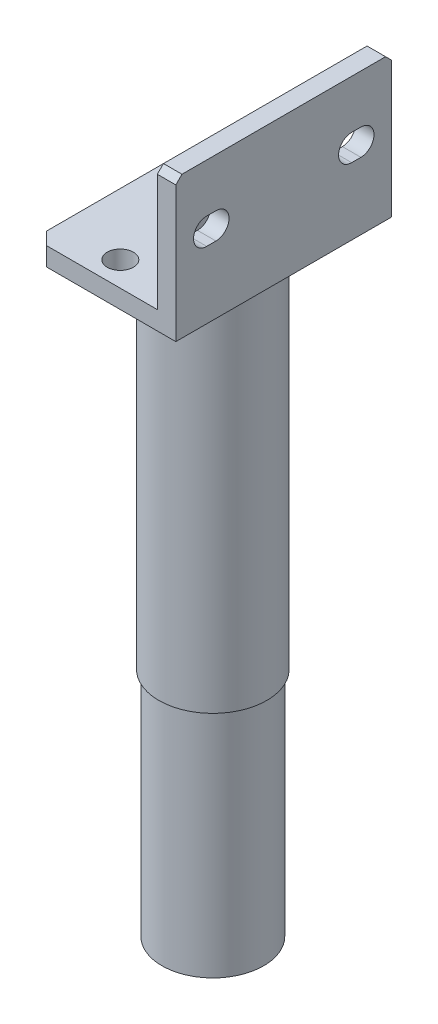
ISO-10303-21;
HEADER;
FILE_DESCRIPTION(('STEP AP214'),'2;1');
FILE_NAME('part.step','',(''),(''),'','','');
FILE_SCHEMA(('AUTOMOTIVE_DESIGN { 1 0 10303 214 1 1 1 1 }'));
ENDSEC;
DATA;
#1=APPLICATION_CONTEXT('core data for automotive mechanical design processes');
#2=APPLICATION_PROTOCOL_DEFINITION('international standard','automotive_design',2000,#1);
#3=PRODUCT_CONTEXT('',#1,'mechanical');
#4=PRODUCT('Part','Part','',(#3));
#5=PRODUCT_RELATED_PRODUCT_CATEGORY('part','',(#4));
#6=PRODUCT_DEFINITION_FORMATION('','',#4);
#7=PRODUCT_DEFINITION_CONTEXT('part definition',#1,'design');
#8=PRODUCT_DEFINITION('design','',#6,#7);
#9=PRODUCT_DEFINITION_SHAPE('','',#8);
#10=(LENGTH_UNIT() NAMED_UNIT(*) SI_UNIT(.MILLI.,.METRE.));
#11=(NAMED_UNIT(*) PLANE_ANGLE_UNIT() SI_UNIT($,.RADIAN.));
#12=(NAMED_UNIT(*) SI_UNIT($,.STERADIAN.) SOLID_ANGLE_UNIT());
#13=UNCERTAINTY_MEASURE_WITH_UNIT(LENGTH_MEASURE(1.E-05),#10,'distance_accuracy_value','');
#14=(GEOMETRIC_REPRESENTATION_CONTEXT(3) GLOBAL_UNCERTAINTY_ASSIGNED_CONTEXT((#13)) GLOBAL_UNIT_ASSIGNED_CONTEXT((#10,
#11,#12)) REPRESENTATION_CONTEXT('',''));
#15=CARTESIAN_POINT('',(0.,0.,0.));
#16=DIRECTION('',(0.,0.,1.));
#17=DIRECTION('',(1.,0.,0.));
#18=AXIS2_PLACEMENT_3D('',#15,#16,#17);
#19=CARTESIAN_POINT('',(23.,-196.,35.));
#20=DIRECTION('',(0.,-1.,0.));
#21=DIRECTION('',(0.,0.,-1.));
#22=AXIS2_PLACEMENT_3D('',#19,#20,#21);
#23=PLANE('',#22);
#24=CARTESIAN_POINT('',(23.,-196.,35.));
#25=DIRECTION('',(0.,-1.,0.));
#26=DIRECTION('',(0.,0.,-1.));
#27=AXIS2_PLACEMENT_3D('',#24,#25,#26);
#28=CIRCLE('',#27,10.);
#29=CARTESIAN_POINT('',(23.,-196.,25.));
#30=VERTEX_POINT('',#29);
#31=EDGE_CURVE('E579',#30,#30,#28,.T.);
#32=ORIENTED_EDGE('',*,*,#31,.F.);
#33=EDGE_LOOP('',(#32));
#34=FACE_BOUND('',#33,.T.);
#35=CARTESIAN_POINT('',(23.,-196.,35.));
#36=DIRECTION('',(0.,1.,0.));
#37=DIRECTION('',(-1.,0.,0.));
#38=AXIS2_PLACEMENT_3D('',#35,#36,#37);
#39=CIRCLE('',#38,16.5);
#40=CARTESIAN_POINT('',(6.5,-196.,35.));
#41=VERTEX_POINT('',#40);
#42=EDGE_CURVE('E569',#41,#41,#39,.T.);
#43=ORIENTED_EDGE('',*,*,#42,.F.);
#44=EDGE_LOOP('',(#43));
#45=FACE_BOUND('',#44,.T.);
#46=ADVANCED_FACE('F32',(#34,#45),#23,.T.);
#47=CARTESIAN_POINT('',(23.,-196.,35.));
#48=DIRECTION('',(0.,1.,0.));
#49=DIRECTION('',(0.,0.,1.));
#50=AXIS2_PLACEMENT_3D('',#47,#48,#49);
#51=CYLINDRICAL_SURFACE('',#50,17.5);
#52=CARTESIAN_POINT('',(23.,0.,35.));
#53=DIRECTION('',(0.,1.,0.));
#54=DIRECTION('',(0.,0.,1.));
#55=AXIS2_PLACEMENT_3D('',#52,#53,#54);
#56=CIRCLE('',#55,17.5);
#57=CARTESIAN_POINT('',(23.,0.,52.5));
#58=VERTEX_POINT('',#57);
#59=EDGE_CURVE('E11',#58,#58,#56,.F.);
#60=ORIENTED_EDGE('',*,*,#59,.T.);
#61=EDGE_LOOP('',(#60));
#62=FACE_BOUND('',#61,.T.);
#63=CARTESIAN_POINT('',(23.,-121.,35.));
#64=DIRECTION('',(0.,1.,0.));
#65=DIRECTION('',(-1.,0.,0.));
#66=AXIS2_PLACEMENT_3D('',#63,#64,#65);
#67=CIRCLE('',#66,17.5);
#68=CARTESIAN_POINT('',(5.49999999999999,-121.,35.));
#69=VERTEX_POINT('',#68);
#70=EDGE_CURVE('E573',#69,#69,#67,.T.);
#71=ORIENTED_EDGE('',*,*,#70,.T.);
#72=EDGE_LOOP('',(#71));
#73=FACE_BOUND('',#72,.T.);
#74=ADVANCED_FACE('F370',(#62,#73),#51,.T.);
#75=CARTESIAN_POINT('',(0.,0.,70.));
#76=DIRECTION('',(0.,1.,0.));
#77=DIRECTION('',(0.,0.,1.));
#78=AXIS2_PLACEMENT_3D('',#75,#76,#77);
#79=PLANE('',#78);
#80=DIRECTION('',(1.,0.,0.));
#81=VECTOR('',#80,1.);
#82=CARTESIAN_POINT('',(0.,0.,70.));
#83=LINE('',#82,#81);
#84=CARTESIAN_POINT('',(4.,0.,70.));
#85=VERTEX_POINT('',#84);
#86=CARTESIAN_POINT('',(46.,0.,70.));
#87=VERTEX_POINT('',#86);
#88=EDGE_CURVE('E244',#85,#87,#83,.T.);
#89=ORIENTED_EDGE('',*,*,#88,.F.);
#90=DIRECTION('',(-0.707106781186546,0.,-0.707106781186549));
#91=VECTOR('',#90,1.);
#92=CARTESIAN_POINT('',(4.,0.,70.));
#93=LINE('',#92,#91);
#94=CARTESIAN_POINT('',(0.,0.,66.));
#95=VERTEX_POINT('',#94);
#96=EDGE_CURVE('E284',#85,#95,#93,.T.);
#97=ORIENTED_EDGE('',*,*,#96,.T.);
#98=DIRECTION('',(0.,0.,-1.));
#99=VECTOR('',#98,1.);
#100=CARTESIAN_POINT('',(0.,0.,70.));
#101=LINE('',#100,#99);
#102=CARTESIAN_POINT('',(0.,0.,4.00000000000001));
#103=VERTEX_POINT('',#102);
#104=EDGE_CURVE('E276',#95,#103,#101,.T.);
#105=ORIENTED_EDGE('',*,*,#104,.T.);
#106=DIRECTION('',(-0.707106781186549,0.,0.707106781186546));
#107=VECTOR('',#106,1.);
#108=CARTESIAN_POINT('',(0.,0.,4.));
#109=LINE('',#108,#107);
#110=CARTESIAN_POINT('',(4.,0.,0.));
#111=VERTEX_POINT('',#110);
#112=EDGE_CURVE('E282',#103,#111,#109,.F.);
#113=ORIENTED_EDGE('',*,*,#112,.T.);
#114=DIRECTION('',(1.,0.,0.));
#115=VECTOR('',#114,1.);
#116=CARTESIAN_POINT('',(0.,0.,0.));
#117=LINE('',#116,#115);
#118=CARTESIAN_POINT('',(46.,0.,0.));
#119=VERTEX_POINT('',#118);
#120=EDGE_CURVE('E243',#111,#119,#117,.T.);
#121=ORIENTED_EDGE('',*,*,#120,.T.);
#122=DIRECTION('',(0.,0.,-1.));
#123=VECTOR('',#122,1.);
#124=CARTESIAN_POINT('',(46.,0.,70.));
#125=LINE('',#124,#123);
#126=EDGE_CURVE('E273',#87,#119,#125,.T.);
#127=ORIENTED_EDGE('',*,*,#126,.F.);
#128=EDGE_LOOP('',(#89,#97,#105,#113,#121,#127));
#129=FACE_BOUND('',#128,.T.);
#130=CARTESIAN_POINT('',(20.,0.,8.));
#131=DIRECTION('',(0.,1.,0.));
#132=DIRECTION('',(0.,0.,1.));
#133=AXIS2_PLACEMENT_3D('',#130,#131,#132);
#134=CIRCLE('',#133,4.25);
#135=CARTESIAN_POINT('',(20.,0.,12.25));
#136=VERTEX_POINT('',#135);
#137=EDGE_CURVE('E240',#136,#136,#134,.T.);
#138=ORIENTED_EDGE('',*,*,#137,.T.);
#139=EDGE_LOOP('',(#138));
#140=FACE_BOUND('',#139,.T.);
#141=CARTESIAN_POINT('',(20.,0.,62.));
#142=DIRECTION('',(0.,1.,0.));
#143=DIRECTION('',(0.,0.,1.));
#144=AXIS2_PLACEMENT_3D('',#141,#142,#143);
#145=CIRCLE('',#144,4.25);
#146=CARTESIAN_POINT('',(20.,0.,66.25));
#147=VERTEX_POINT('',#146);
#148=EDGE_CURVE('E190',#147,#147,#145,.F.);
#149=ORIENTED_EDGE('',*,*,#148,.F.);
#150=EDGE_LOOP('',(#149));
#151=FACE_BOUND('',#150,.T.);
#152=ORIENTED_EDGE('',*,*,#59,.F.);
#153=EDGE_LOOP('',(#152));
#154=FACE_BOUND('',#153,.T.);
#155=ADVANCED_FACE('F351',(#129,#140,#151,#154),#79,.F.);
#156=CARTESIAN_POINT('',(40.,6.00000000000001,70.));
#157=DIRECTION('',(0.,-1.,0.));
#158=DIRECTION('',(1.,0.,0.));
#159=AXIS2_PLACEMENT_3D('',#156,#157,#158);
#160=PLANE('',#159);
#161=CARTESIAN_POINT('',(23.,6.00000000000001,35.));
#162=DIRECTION('',(0.,-1.,0.));
#163=DIRECTION('',(1.,0.,0.));
#164=AXIS2_PLACEMENT_3D('',#161,#162,#163);
#165=CIRCLE('',#164,10.);
#166=CARTESIAN_POINT('',(33.,6.00000000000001,35.));
#167=VERTEX_POINT('',#166);
#168=EDGE_CURVE('E36',#167,#167,#165,.T.);
#169=ORIENTED_EDGE('',*,*,#168,.T.);
#170=EDGE_LOOP('',(#169));
#171=FACE_BOUND('',#170,.T.);
#172=DIRECTION('',(0.,0.,-1.));
#173=VECTOR('',#172,1.);
#174=CARTESIAN_POINT('',(0.,6.00000000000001,70.));
#175=LINE('',#174,#173);
#176=CARTESIAN_POINT('',(0.,6.00000000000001,66.));
#177=VERTEX_POINT('',#176);
#178=CARTESIAN_POINT('',(0.,6.00000000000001,4.00000000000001));
#179=VERTEX_POINT('',#178);
#180=EDGE_CURVE('E255',#177,#179,#175,.T.);
#181=ORIENTED_EDGE('',*,*,#180,.F.);
#182=DIRECTION('',(0.707106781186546,0.,0.707106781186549));
#183=VECTOR('',#182,1.);
#184=CARTESIAN_POINT('',(4.,6.00000000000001,70.));
#185=LINE('',#184,#183);
#186=CARTESIAN_POINT('',(4.,6.00000000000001,70.));
#187=VERTEX_POINT('',#186);
#188=EDGE_CURVE('E293',#177,#187,#185,.T.);
#189=ORIENTED_EDGE('',*,*,#188,.T.);
#190=DIRECTION('',(-1.,0.,0.));
#191=VECTOR('',#190,1.);
#192=CARTESIAN_POINT('',(40.,6.00000000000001,70.));
#193=LINE('',#192,#191);
#194=CARTESIAN_POINT('',(40.,6.00000000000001,70.));
#195=VERTEX_POINT('',#194);
#196=EDGE_CURVE('E252',#195,#187,#193,.T.);
#197=ORIENTED_EDGE('',*,*,#196,.F.);
#198=DIRECTION('',(0.,0.,-1.));
#199=VECTOR('',#198,1.);
#200=CARTESIAN_POINT('',(40.,6.00000000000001,70.));
#201=LINE('',#200,#199);
#202=CARTESIAN_POINT('',(40.,6.00000000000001,0.));
#203=VERTEX_POINT('',#202);
#204=EDGE_CURVE('E265',#195,#203,#201,.T.);
#205=ORIENTED_EDGE('',*,*,#204,.T.);
#206=DIRECTION('',(-1.,0.,0.));
#207=VECTOR('',#206,1.);
#208=CARTESIAN_POINT('',(40.,6.00000000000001,0.));
#209=LINE('',#208,#207);
#210=CARTESIAN_POINT('',(4.00000000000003,6.00000000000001,0.));
#211=VERTEX_POINT('',#210);
#212=EDGE_CURVE('E247',#203,#211,#209,.T.);
#213=ORIENTED_EDGE('',*,*,#212,.T.);
#214=DIRECTION('',(0.707106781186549,0.,-0.707106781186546));
#215=VECTOR('',#214,1.);
#216=CARTESIAN_POINT('',(0.,6.00000000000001,4.));
#217=LINE('',#216,#215);
#218=EDGE_CURVE('E291',#211,#179,#217,.F.);
#219=ORIENTED_EDGE('',*,*,#218,.T.);
#220=EDGE_LOOP('',(#181,#189,#197,#205,#213,#219));
#221=FACE_BOUND('',#220,.T.);
#222=CARTESIAN_POINT('',(20.,6.00000000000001,8.));
#223=DIRECTION('',(0.,1.,0.));
#224=DIRECTION('',(-1.,0.,0.));
#225=AXIS2_PLACEMENT_3D('',#222,#223,#224);
#226=CIRCLE('',#225,4.25);
#227=CARTESIAN_POINT('',(15.75,6.,8.));
#228=VERTEX_POINT('',#227);
#229=EDGE_CURVE('E231',#228,#228,#226,.T.);
#230=ORIENTED_EDGE('',*,*,#229,.F.);
#231=EDGE_LOOP('',(#230));
#232=FACE_BOUND('',#231,.T.);
#233=CARTESIAN_POINT('',(20.,6.00000000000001,62.));
#234=DIRECTION('',(0.,-1.,0.));
#235=DIRECTION('',(-1.,0.,0.));
#236=AXIS2_PLACEMENT_3D('',#233,#234,#235);
#237=CIRCLE('',#236,4.25);
#238=CARTESIAN_POINT('',(15.75,6.,62.));
#239=VERTEX_POINT('',#238);
#240=EDGE_CURVE('E581',#239,#239,#237,.T.);
#241=ORIENTED_EDGE('',*,*,#240,.T.);
#242=EDGE_LOOP('',(#241));
#243=FACE_BOUND('',#242,.T.);
#244=ADVANCED_FACE('F340',(#171,#221,#232,#243),#160,.F.);
#245=CARTESIAN_POINT('',(46.,0.,70.));
#246=DIRECTION('',(-1.,0.,0.));
#247=DIRECTION('',(0.,0.,1.));
#248=AXIS2_PLACEMENT_3D('',#245,#246,#247);
#249=PLANE('',#248);
#250=DIRECTION('',(0.,0.,-1.));
#251=VECTOR('',#250,1.);
#252=CARTESIAN_POINT('',(46.,46.,70.));
#253=LINE('',#252,#251);
#254=CARTESIAN_POINT('',(46.,46.,68.));
#255=VERTEX_POINT('',#254);
#256=CARTESIAN_POINT('',(46.,46.,2.00000000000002));
#257=VERTEX_POINT('',#256);
#258=EDGE_CURVE('E271',#255,#257,#253,.T.);
#259=ORIENTED_EDGE('',*,*,#258,.F.);
#260=DIRECTION('',(0.,-0.707106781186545,0.70710678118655));
#261=VECTOR('',#260,1.);
#262=CARTESIAN_POINT('',(46.,44.,70.));
#263=LINE('',#262,#261);
#264=CARTESIAN_POINT('',(46.,44.,70.));
#265=VERTEX_POINT('',#264);
#266=EDGE_CURVE('E310',#255,#265,#263,.T.);
#267=ORIENTED_EDGE('',*,*,#266,.T.);
#268=DIRECTION('',(0.,1.,0.));
#269=VECTOR('',#268,1.);
#270=CARTESIAN_POINT('',(46.,0.,70.));
#271=LINE('',#270,#269);
#272=EDGE_CURVE('E246',#87,#265,#271,.T.);
#273=ORIENTED_EDGE('',*,*,#272,.F.);
#274=ORIENTED_EDGE('',*,*,#126,.T.);
#275=DIRECTION('',(0.,1.,0.));
#276=VECTOR('',#275,1.);
#277=CARTESIAN_POINT('',(46.,0.,0.));
#278=LINE('',#277,#276);
#279=CARTESIAN_POINT('',(46.,44.,0.));
#280=VERTEX_POINT('',#279);
#281=EDGE_CURVE('E257',#119,#280,#278,.T.);
#282=ORIENTED_EDGE('',*,*,#281,.T.);
#283=DIRECTION('',(0.,-0.70710678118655,-0.707106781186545));
#284=VECTOR('',#283,1.);
#285=CARTESIAN_POINT('',(46.,46.,2.));
#286=LINE('',#285,#284);
#287=EDGE_CURVE('E54',#280,#257,#286,.F.);
#288=ORIENTED_EDGE('',*,*,#287,.T.);
#289=EDGE_LOOP('',(#259,#267,#273,#274,#282,#288));
#290=FACE_BOUND('',#289,.T.);
#291=DIRECTION('',(0.,0.,-1.));
#292=VECTOR('',#291,1.);
#293=CARTESIAN_POINT('',(46.,30.25,10.));
#294=LINE('',#293,#292);
#295=CARTESIAN_POINT('',(46.,30.25,13.));
#296=VERTEX_POINT('',#295);
#297=CARTESIAN_POINT('',(46.,30.25,10.));
#298=VERTEX_POINT('',#297);
#299=EDGE_CURVE('E216',#296,#298,#294,.T.);
#300=ORIENTED_EDGE('',*,*,#299,.T.);
#301=CARTESIAN_POINT('',(46.,26.,10.));
#302=DIRECTION('',(-1.,0.,0.));
#303=DIRECTION('',(0.,-1.,0.));
#304=AXIS2_PLACEMENT_3D('',#301,#302,#303);
#305=CIRCLE('',#304,4.25);
#306=CARTESIAN_POINT('',(46.,21.75,10.));
#307=VERTEX_POINT('',#306);
#308=EDGE_CURVE('E206',#298,#307,#305,.T.);
#309=ORIENTED_EDGE('',*,*,#308,.T.);
#310=DIRECTION('',(0.,0.,1.));
#311=VECTOR('',#310,1.);
#312=CARTESIAN_POINT('',(46.,21.75,10.));
#313=LINE('',#312,#311);
#314=CARTESIAN_POINT('',(46.,21.75,13.));
#315=VERTEX_POINT('',#314);
#316=EDGE_CURVE('E209',#307,#315,#313,.T.);
#317=ORIENTED_EDGE('',*,*,#316,.T.);
#318=CARTESIAN_POINT('',(46.,26.,13.));
#319=DIRECTION('',(-1.,0.,0.));
#320=DIRECTION('',(0.,-1.,0.));
#321=AXIS2_PLACEMENT_3D('',#318,#319,#320);
#322=CIRCLE('',#321,4.25);
#323=EDGE_CURVE('E213',#315,#296,#322,.T.);
#324=ORIENTED_EDGE('',*,*,#323,.T.);
#325=EDGE_LOOP('',(#300,#309,#317,#324));
#326=FACE_BOUND('',#325,.T.);
#327=CARTESIAN_POINT('',(46.,26.,60.));
#328=DIRECTION('',(1.,0.,0.));
#329=DIRECTION('',(0.,-1.,0.));
#330=AXIS2_PLACEMENT_3D('',#327,#328,#329);
#331=CIRCLE('',#330,4.25);
#332=CARTESIAN_POINT('',(46.,30.25,60.));
#333=VERTEX_POINT('',#332);
#334=CARTESIAN_POINT('',(46.,21.75,60.));
#335=VERTEX_POINT('',#334);
#336=EDGE_CURVE('E172',#333,#335,#331,.T.);
#337=ORIENTED_EDGE('',*,*,#336,.F.);
#338=DIRECTION('',(0.,0.,1.));
#339=VECTOR('',#338,1.);
#340=CARTESIAN_POINT('',(46.,30.25,60.));
#341=LINE('',#340,#339);
#342=CARTESIAN_POINT('',(46.,30.25,57.));
#343=VERTEX_POINT('',#342);
#344=EDGE_CURVE('E160',#343,#333,#341,.T.);
#345=ORIENTED_EDGE('',*,*,#344,.F.);
#346=CARTESIAN_POINT('',(46.,26.,57.));
#347=DIRECTION('',(1.,0.,0.));
#348=DIRECTION('',(0.,-1.,0.));
#349=AXIS2_PLACEMENT_3D('',#346,#347,#348);
#350=CIRCLE('',#349,4.25);
#351=CARTESIAN_POINT('',(46.,21.75,57.));
#352=VERTEX_POINT('',#351);
#353=EDGE_CURVE('E171',#352,#343,#350,.T.);
#354=ORIENTED_EDGE('',*,*,#353,.F.);
#355=DIRECTION('',(0.,0.,-1.));
#356=VECTOR('',#355,1.);
#357=CARTESIAN_POINT('',(46.,21.75,60.));
#358=LINE('',#357,#356);
#359=EDGE_CURVE('E180',#335,#352,#358,.T.);
#360=ORIENTED_EDGE('',*,*,#359,.F.);
#361=EDGE_LOOP('',(#337,#345,#354,#360));
#362=FACE_BOUND('',#361,.T.);
#363=ADVANCED_FACE('F183',(#290,#326,#362),#249,.F.);
#364=CARTESIAN_POINT('',(40.,46.,70.));
#365=DIRECTION('',(1.,0.,0.));
#366=DIRECTION('',(0.,1.,0.));
#367=AXIS2_PLACEMENT_3D('',#364,#365,#366);
#368=PLANE('',#367);
#369=DIRECTION('',(0.,-1.,0.));
#370=VECTOR('',#369,1.);
#371=CARTESIAN_POINT('',(40.,46.,70.));
#372=LINE('',#371,#370);
#373=CARTESIAN_POINT('',(40.,44.,70.));
#374=VERTEX_POINT('',#373);
#375=EDGE_CURVE('E250',#374,#195,#372,.T.);
#376=ORIENTED_EDGE('',*,*,#375,.F.);
#377=DIRECTION('',(0.,0.707106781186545,-0.70710678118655));
#378=VECTOR('',#377,1.);
#379=CARTESIAN_POINT('',(40.,44.,70.));
#380=LINE('',#379,#378);
#381=CARTESIAN_POINT('',(40.,46.,68.));
#382=VERTEX_POINT('',#381);
#383=EDGE_CURVE('E302',#374,#382,#380,.T.);
#384=ORIENTED_EDGE('',*,*,#383,.T.);
#385=DIRECTION('',(0.,0.,-1.));
#386=VECTOR('',#385,1.);
#387=CARTESIAN_POINT('',(40.,46.,70.));
#388=LINE('',#387,#386);
#389=CARTESIAN_POINT('',(40.,46.,2.00000000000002));
#390=VERTEX_POINT('',#389);
#391=EDGE_CURVE('E268',#382,#390,#388,.T.);
#392=ORIENTED_EDGE('',*,*,#391,.T.);
#393=DIRECTION('',(0.,0.70710678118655,0.707106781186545));
#394=VECTOR('',#393,1.);
#395=CARTESIAN_POINT('',(40.,46.,2.));
#396=LINE('',#395,#394);
#397=CARTESIAN_POINT('',(40.,44.,0.));
#398=VERTEX_POINT('',#397);
#399=EDGE_CURVE('E300',#390,#398,#396,.F.);
#400=ORIENTED_EDGE('',*,*,#399,.T.);
#401=DIRECTION('',(0.,-1.,0.));
#402=VECTOR('',#401,1.);
#403=CARTESIAN_POINT('',(40.,46.,0.));
#404=LINE('',#403,#402);
#405=EDGE_CURVE('E259',#398,#203,#404,.T.);
#406=ORIENTED_EDGE('',*,*,#405,.T.);
#407=ORIENTED_EDGE('',*,*,#204,.F.);
#408=EDGE_LOOP('',(#376,#384,#392,#400,#406,#407));
#409=FACE_BOUND('',#408,.T.);
#410=DIRECTION('',(0.,0.,1.));
#411=VECTOR('',#410,1.);
#412=CARTESIAN_POINT('',(40.,21.75,10.));
#413=LINE('',#412,#411);
#414=CARTESIAN_POINT('',(40.,21.75,10.));
#415=VERTEX_POINT('',#414);
#416=CARTESIAN_POINT('',(40.,21.75,13.));
#417=VERTEX_POINT('',#416);
#418=EDGE_CURVE('E221',#415,#417,#413,.T.);
#419=ORIENTED_EDGE('',*,*,#418,.F.);
#420=CARTESIAN_POINT('',(40.,26.,10.));
#421=DIRECTION('',(-1.,0.,0.));
#422=DIRECTION('',(0.,-1.,0.));
#423=AXIS2_PLACEMENT_3D('',#420,#421,#422);
#424=CIRCLE('',#423,4.25);
#425=CARTESIAN_POINT('',(40.,30.25,10.));
#426=VERTEX_POINT('',#425);
#427=EDGE_CURVE('E202',#426,#415,#424,.T.);
#428=ORIENTED_EDGE('',*,*,#427,.F.);
#429=DIRECTION('',(0.,0.,-1.));
#430=VECTOR('',#429,1.);
#431=CARTESIAN_POINT('',(40.,30.25,10.));
#432=LINE('',#431,#430);
#433=CARTESIAN_POINT('',(40.,30.25,13.));
#434=VERTEX_POINT('',#433);
#435=EDGE_CURVE('E210',#434,#426,#432,.T.);
#436=ORIENTED_EDGE('',*,*,#435,.F.);
#437=CARTESIAN_POINT('',(40.,26.,13.));
#438=DIRECTION('',(-1.,0.,0.));
#439=DIRECTION('',(0.,-1.,0.));
#440=AXIS2_PLACEMENT_3D('',#437,#438,#439);
#441=CIRCLE('',#440,4.25);
#442=EDGE_CURVE('E224',#417,#434,#441,.T.);
#443=ORIENTED_EDGE('',*,*,#442,.F.);
#444=EDGE_LOOP('',(#419,#428,#436,#443));
#445=FACE_BOUND('',#444,.T.);
#446=CARTESIAN_POINT('',(40.,26.,60.));
#447=DIRECTION('',(1.,0.,0.));
#448=DIRECTION('',(0.,-1.,0.));
#449=AXIS2_PLACEMENT_3D('',#446,#447,#448);
#450=CIRCLE('',#449,4.25);
#451=CARTESIAN_POINT('',(40.,30.25,60.));
#452=VERTEX_POINT('',#451);
#453=CARTESIAN_POINT('',(40.,21.75,60.));
#454=VERTEX_POINT('',#453);
#455=EDGE_CURVE('E179',#452,#454,#450,.T.);
#456=ORIENTED_EDGE('',*,*,#455,.T.);
#457=DIRECTION('',(0.,0.,-1.));
#458=VECTOR('',#457,1.);
#459=CARTESIAN_POINT('',(40.,21.75,60.));
#460=LINE('',#459,#458);
#461=CARTESIAN_POINT('',(40.,21.75,57.));
#462=VERTEX_POINT('',#461);
#463=EDGE_CURVE('E184',#454,#462,#460,.T.);
#464=ORIENTED_EDGE('',*,*,#463,.T.);
#465=CARTESIAN_POINT('',(40.,26.,57.));
#466=DIRECTION('',(1.,0.,0.));
#467=DIRECTION('',(0.,-1.,0.));
#468=AXIS2_PLACEMENT_3D('',#465,#466,#467);
#469=CIRCLE('',#468,4.25);
#470=CARTESIAN_POINT('',(40.,30.25,57.));
#471=VERTEX_POINT('',#470);
#472=EDGE_CURVE('E187',#462,#471,#469,.T.);
#473=ORIENTED_EDGE('',*,*,#472,.T.);
#474=DIRECTION('',(0.,0.,1.));
#475=VECTOR('',#474,1.);
#476=CARTESIAN_POINT('',(40.,30.25,60.));
#477=LINE('',#476,#475);
#478=EDGE_CURVE('E196',#471,#452,#477,.T.);
#479=ORIENTED_EDGE('',*,*,#478,.T.);
#480=EDGE_LOOP('',(#456,#464,#473,#479));
#481=FACE_BOUND('',#480,.T.);
#482=ADVANCED_FACE('F326',(#409,#445,#481),#368,.F.);
#483=CARTESIAN_POINT('',(0.,0.,70.));
#484=DIRECTION('',(1.,0.,0.));
#485=DIRECTION('',(0.,0.,-1.));
#486=AXIS2_PLACEMENT_3D('',#483,#484,#485);
#487=PLANE('',#486);
#488=ORIENTED_EDGE('',*,*,#104,.F.);
#489=DIRECTION('',(0.,1.,0.));
#490=VECTOR('',#489,1.);
#491=CARTESIAN_POINT('',(0.,6.00000000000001,66.));
#492=LINE('',#491,#490);
#493=EDGE_CURVE('E289',#95,#177,#492,.T.);
#494=ORIENTED_EDGE('',*,*,#493,.T.);
#495=ORIENTED_EDGE('',*,*,#180,.T.);
#496=DIRECTION('',(0.,-1.,0.));
#497=VECTOR('',#496,1.);
#498=CARTESIAN_POINT('',(0.,0.,4.));
#499=LINE('',#498,#497);
#500=EDGE_CURVE('E286',#179,#103,#499,.T.);
#501=ORIENTED_EDGE('',*,*,#500,.T.);
#502=EDGE_LOOP('',(#488,#494,#495,#501));
#503=FACE_BOUND('',#502,.T.);
#504=ADVANCED_FACE('F348',(#503),#487,.F.);
#505=CARTESIAN_POINT('',(40.,46.,70.));
#506=DIRECTION('',(0.,-1.,0.));
#507=DIRECTION('',(0.,0.,-1.));
#508=AXIS2_PLACEMENT_3D('',#505,#506,#507);
#509=PLANE('',#508);
#510=ORIENTED_EDGE('',*,*,#391,.F.);
#511=DIRECTION('',(1.,0.,0.));
#512=VECTOR('',#511,1.);
#513=CARTESIAN_POINT('',(46.,46.,68.));
#514=LINE('',#513,#512);
#515=EDGE_CURVE('E307',#382,#255,#514,.T.);
#516=ORIENTED_EDGE('',*,*,#515,.T.);
#517=ORIENTED_EDGE('',*,*,#258,.T.);
#518=DIRECTION('',(-1.,0.,0.));
#519=VECTOR('',#518,1.);
#520=CARTESIAN_POINT('',(40.,46.,2.));
#521=LINE('',#520,#519);
#522=EDGE_CURVE('E304',#257,#390,#521,.T.);
#523=ORIENTED_EDGE('',*,*,#522,.T.);
#524=EDGE_LOOP('',(#510,#516,#517,#523));
#525=FACE_BOUND('',#524,.T.);
#526=ADVANCED_FACE('F330',(#525),#509,.F.);
#527=CARTESIAN_POINT('',(0.,6.00000000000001,70.));
#528=DIRECTION('',(0.,0.,1.));
#529=DIRECTION('',(1.,0.,0.));
#530=AXIS2_PLACEMENT_3D('',#527,#528,#529);
#531=PLANE('',#530);
#532=ORIENTED_EDGE('',*,*,#272,.T.);
#533=DIRECTION('',(-1.,0.,0.));
#534=VECTOR('',#533,1.);
#535=CARTESIAN_POINT('',(40.,44.,70.));
#536=LINE('',#535,#534);
#537=EDGE_CURVE('E297',#265,#374,#536,.T.);
#538=ORIENTED_EDGE('',*,*,#537,.T.);
#539=ORIENTED_EDGE('',*,*,#375,.T.);
#540=ORIENTED_EDGE('',*,*,#196,.T.);
#541=DIRECTION('',(0.,-1.,0.));
#542=VECTOR('',#541,1.);
#543=CARTESIAN_POINT('',(4.,0.,70.));
#544=LINE('',#543,#542);
#545=EDGE_CURVE('E279',#187,#85,#544,.T.);
#546=ORIENTED_EDGE('',*,*,#545,.T.);
#547=ORIENTED_EDGE('',*,*,#88,.T.);
#548=EDGE_LOOP('',(#532,#538,#539,#540,#546,#547));
#549=FACE_BOUND('',#548,.T.);
#550=ADVANCED_FACE('F319',(#549),#531,.T.);
#551=CARTESIAN_POINT('',(0.,6.00000000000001,0.));
#552=DIRECTION('',(0.,0.,1.));
#553=DIRECTION('',(1.,0.,0.));
#554=AXIS2_PLACEMENT_3D('',#551,#552,#553);
#555=PLANE('',#554);
#556=ORIENTED_EDGE('',*,*,#405,.F.);
#557=DIRECTION('',(1.,0.,0.));
#558=VECTOR('',#557,1.);
#559=CARTESIAN_POINT('',(0.,44.,0.));
#560=LINE('',#559,#558);
#561=EDGE_CURVE('E41',#398,#280,#560,.T.);
#562=ORIENTED_EDGE('',*,*,#561,.T.);
#563=ORIENTED_EDGE('',*,*,#281,.F.);
#564=ORIENTED_EDGE('',*,*,#120,.F.);
#565=DIRECTION('',(0.,1.,0.));
#566=VECTOR('',#565,1.);
#567=CARTESIAN_POINT('',(4.,6.00000000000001,0.));
#568=LINE('',#567,#566);
#569=EDGE_CURVE('E295',#111,#211,#568,.T.);
#570=ORIENTED_EDGE('',*,*,#569,.T.);
#571=ORIENTED_EDGE('',*,*,#212,.F.);
#572=EDGE_LOOP('',(#556,#562,#563,#564,#570,#571));
#573=FACE_BOUND('',#572,.T.);
#574=ADVANCED_FACE('F334',(#573),#555,.F.);
#575=CARTESIAN_POINT('',(20.,-394.,8.));
#576=DIRECTION('',(0.,1.,0.));
#577=DIRECTION('',(-1.,0.,0.));
#578=AXIS2_PLACEMENT_3D('',#575,#576,#577);
#579=CYLINDRICAL_SURFACE('',#578,4.25);
#580=ORIENTED_EDGE('',*,*,#229,.T.);
#581=EDGE_LOOP('',(#580));
#582=FACE_BOUND('',#581,.T.);
#583=ORIENTED_EDGE('',*,*,#137,.F.);
#584=EDGE_LOOP('',(#583));
#585=FACE_BOUND('',#584,.T.);
#586=ADVANCED_FACE('F358',(#582,#585),#579,.F.);
#587=CARTESIAN_POINT('',(4.,6.00000000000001,70.));
#588=DIRECTION('',(-0.707106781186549,0.,0.707106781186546));
#589=DIRECTION('',(0.707106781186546,0.,0.707106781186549));
#590=AXIS2_PLACEMENT_3D('',#587,#588,#589);
#591=PLANE('',#590);
#592=ORIENTED_EDGE('',*,*,#188,.F.);
#593=ORIENTED_EDGE('',*,*,#493,.F.);
#594=ORIENTED_EDGE('',*,*,#96,.F.);
#595=ORIENTED_EDGE('',*,*,#545,.F.);
#596=EDGE_LOOP('',(#592,#593,#594,#595));
#597=FACE_BOUND('',#596,.T.);
#598=ADVANCED_FACE('F356',(#597),#591,.T.);
#599=CARTESIAN_POINT('',(0.,0.,4.));
#600=DIRECTION('',(0.707106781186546,0.,0.707106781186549));
#601=DIRECTION('',(0.707106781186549,0.,-0.707106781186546));
#602=AXIS2_PLACEMENT_3D('',#599,#600,#601);
#603=PLANE('',#602);
#604=ORIENTED_EDGE('',*,*,#218,.F.);
#605=ORIENTED_EDGE('',*,*,#569,.F.);
#606=ORIENTED_EDGE('',*,*,#112,.F.);
#607=ORIENTED_EDGE('',*,*,#500,.F.);
#608=EDGE_LOOP('',(#604,#605,#606,#607));
#609=FACE_BOUND('',#608,.T.);
#610=ADVANCED_FACE('F345',(#609),#603,.F.);
#611=CARTESIAN_POINT('',(46.,26.,10.));
#612=DIRECTION('',(-1.,0.,0.));
#613=DIRECTION('',(0.,-1.,0.));
#614=AXIS2_PLACEMENT_3D('',#611,#612,#613);
#615=CYLINDRICAL_SURFACE('',#614,4.25);
#616=ORIENTED_EDGE('',*,*,#427,.T.);
#617=DIRECTION('',(-1.,0.,0.));
#618=VECTOR('',#617,1.);
#619=CARTESIAN_POINT('',(46.,21.75,10.));
#620=LINE('',#619,#618);
#621=EDGE_CURVE('E219',#307,#415,#620,.T.);
#622=ORIENTED_EDGE('',*,*,#621,.F.);
#623=ORIENTED_EDGE('',*,*,#308,.F.);
#624=DIRECTION('',(-1.,0.,0.));
#625=VECTOR('',#624,1.);
#626=CARTESIAN_POINT('',(46.,30.25,10.));
#627=LINE('',#626,#625);
#628=EDGE_CURVE('E229',#298,#426,#627,.T.);
#629=ORIENTED_EDGE('',*,*,#628,.T.);
#630=EDGE_LOOP('',(#616,#622,#623,#629));
#631=FACE_BOUND('',#630,.T.);
#632=ADVANCED_FACE('F364',(#631),#615,.F.);
#633=CARTESIAN_POINT('',(46.,30.25,10.));
#634=DIRECTION('',(0.,1.,0.));
#635=DIRECTION('',(-1.,0.,0.));
#636=AXIS2_PLACEMENT_3D('',#633,#634,#635);
#637=PLANE('',#636);
#638=ORIENTED_EDGE('',*,*,#435,.T.);
#639=ORIENTED_EDGE('',*,*,#628,.F.);
#640=ORIENTED_EDGE('',*,*,#299,.F.);
#641=DIRECTION('',(-1.,0.,0.));
#642=VECTOR('',#641,1.);
#643=CARTESIAN_POINT('',(46.,30.25,13.));
#644=LINE('',#643,#642);
#645=EDGE_CURVE('E232',#296,#434,#644,.T.);
#646=ORIENTED_EDGE('',*,*,#645,.T.);
#647=EDGE_LOOP('',(#638,#639,#640,#646));
#648=FACE_BOUND('',#647,.T.);
#649=ADVANCED_FACE('F401',(#648),#637,.F.);
#650=CARTESIAN_POINT('',(46.,26.,13.));
#651=DIRECTION('',(-1.,0.,0.));
#652=DIRECTION('',(0.,-1.,0.));
#653=AXIS2_PLACEMENT_3D('',#650,#651,#652);
#654=CYLINDRICAL_SURFACE('',#653,4.25);
#655=ORIENTED_EDGE('',*,*,#442,.T.);
#656=ORIENTED_EDGE('',*,*,#645,.F.);
#657=ORIENTED_EDGE('',*,*,#323,.F.);
#658=DIRECTION('',(-1.,0.,0.));
#659=VECTOR('',#658,1.);
#660=CARTESIAN_POINT('',(46.,21.75,13.));
#661=LINE('',#660,#659);
#662=EDGE_CURVE('E234',#315,#417,#661,.T.);
#663=ORIENTED_EDGE('',*,*,#662,.T.);
#664=EDGE_LOOP('',(#655,#656,#657,#663));
#665=FACE_BOUND('',#664,.T.);
#666=ADVANCED_FACE('F404',(#665),#654,.F.);
#667=CARTESIAN_POINT('',(46.,21.75,10.));
#668=DIRECTION('',(0.,-1.,0.));
#669=DIRECTION('',(1.,0.,0.));
#670=AXIS2_PLACEMENT_3D('',#667,#668,#669);
#671=PLANE('',#670);
#672=ORIENTED_EDGE('',*,*,#418,.T.);
#673=ORIENTED_EDGE('',*,*,#662,.F.);
#674=ORIENTED_EDGE('',*,*,#316,.F.);
#675=ORIENTED_EDGE('',*,*,#621,.T.);
#676=EDGE_LOOP('',(#672,#673,#674,#675));
#677=FACE_BOUND('',#676,.T.);
#678=ADVANCED_FACE('F400',(#677),#671,.F.);
#679=CARTESIAN_POINT('',(46.,26.,60.));
#680=DIRECTION('',(-1.,0.,0.));
#681=DIRECTION('',(0.,-1.,0.));
#682=AXIS2_PLACEMENT_3D('',#679,#680,#681);
#683=CYLINDRICAL_SURFACE('',#682,4.25);
#684=ORIENTED_EDGE('',*,*,#455,.F.);
#685=DIRECTION('',(-1.,0.,0.));
#686=VECTOR('',#685,1.);
#687=CARTESIAN_POINT('',(46.,30.25,60.));
#688=LINE('',#687,#686);
#689=EDGE_CURVE('E164',#333,#452,#688,.T.);
#690=ORIENTED_EDGE('',*,*,#689,.F.);
#691=ORIENTED_EDGE('',*,*,#336,.T.);
#692=DIRECTION('',(-1.,0.,0.));
#693=VECTOR('',#692,1.);
#694=CARTESIAN_POINT('',(46.,21.75,60.));
#695=LINE('',#694,#693);
#696=EDGE_CURVE('E200',#335,#454,#695,.T.);
#697=ORIENTED_EDGE('',*,*,#696,.T.);
#698=EDGE_LOOP('',(#684,#690,#691,#697));
#699=FACE_BOUND('',#698,.T.);
#700=ADVANCED_FACE('F175',(#699),#683,.F.);
#701=CARTESIAN_POINT('',(46.,21.75,60.));
#702=DIRECTION('',(0.,1.,0.));
#703=DIRECTION('',(-1.,0.,0.));
#704=AXIS2_PLACEMENT_3D('',#701,#702,#703);
#705=PLANE('',#704);
#706=ORIENTED_EDGE('',*,*,#463,.F.);
#707=ORIENTED_EDGE('',*,*,#696,.F.);
#708=ORIENTED_EDGE('',*,*,#359,.T.);
#709=DIRECTION('',(-1.,0.,0.));
#710=VECTOR('',#709,1.);
#711=CARTESIAN_POINT('',(46.,21.75,57.));
#712=LINE('',#711,#710);
#713=EDGE_CURVE('E203',#352,#462,#712,.T.);
#714=ORIENTED_EDGE('',*,*,#713,.T.);
#715=EDGE_LOOP('',(#706,#707,#708,#714));
#716=FACE_BOUND('',#715,.T.);
#717=ADVANCED_FACE('F388',(#716),#705,.T.);
#718=CARTESIAN_POINT('',(46.,26.,57.));
#719=DIRECTION('',(-1.,0.,0.));
#720=DIRECTION('',(0.,-1.,0.));
#721=AXIS2_PLACEMENT_3D('',#718,#719,#720);
#722=CYLINDRICAL_SURFACE('',#721,4.25);
#723=ORIENTED_EDGE('',*,*,#472,.F.);
#724=ORIENTED_EDGE('',*,*,#713,.F.);
#725=ORIENTED_EDGE('',*,*,#353,.T.);
#726=DIRECTION('',(-1.,0.,0.));
#727=VECTOR('',#726,1.);
#728=CARTESIAN_POINT('',(46.,30.25,57.));
#729=LINE('',#728,#727);
#730=EDGE_CURVE('E166',#343,#471,#729,.T.);
#731=ORIENTED_EDGE('',*,*,#730,.T.);
#732=EDGE_LOOP('',(#723,#724,#725,#731));
#733=FACE_BOUND('',#732,.T.);
#734=ADVANCED_FACE('F391',(#733),#722,.F.);
#735=CARTESIAN_POINT('',(46.,30.25,60.));
#736=DIRECTION('',(0.,-1.,0.));
#737=DIRECTION('',(1.,0.,0.));
#738=AXIS2_PLACEMENT_3D('',#735,#736,#737);
#739=PLANE('',#738);
#740=ORIENTED_EDGE('',*,*,#478,.F.);
#741=ORIENTED_EDGE('',*,*,#730,.F.);
#742=ORIENTED_EDGE('',*,*,#344,.T.);
#743=ORIENTED_EDGE('',*,*,#689,.T.);
#744=EDGE_LOOP('',(#740,#741,#742,#743));
#745=FACE_BOUND('',#744,.T.);
#746=ADVANCED_FACE('F163',(#745),#739,.T.);
#747=CARTESIAN_POINT('',(20.,-394.,62.));
#748=DIRECTION('',(0.,1.,0.));
#749=DIRECTION('',(-1.,0.,0.));
#750=AXIS2_PLACEMENT_3D('',#747,#748,#749);
#751=CYLINDRICAL_SURFACE('',#750,4.25);
#752=ORIENTED_EDGE('',*,*,#240,.F.);
#753=EDGE_LOOP('',(#752));
#754=FACE_BOUND('',#753,.T.);
#755=ORIENTED_EDGE('',*,*,#148,.T.);
#756=EDGE_LOOP('',(#755));
#757=FACE_BOUND('',#756,.T.);
#758=ADVANCED_FACE('F384',(#754,#757),#751,.F.);
#759=CARTESIAN_POINT('',(0.,44.,70.));
#760=DIRECTION('',(0.,0.70710678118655,0.707106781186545));
#761=DIRECTION('',(0.,-0.707106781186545,0.70710678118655));
#762=AXIS2_PLACEMENT_3D('',#759,#760,#761);
#763=PLANE('',#762);
#764=ORIENTED_EDGE('',*,*,#266,.F.);
#765=ORIENTED_EDGE('',*,*,#515,.F.);
#766=ORIENTED_EDGE('',*,*,#383,.F.);
#767=ORIENTED_EDGE('',*,*,#537,.F.);
#768=EDGE_LOOP('',(#764,#765,#766,#767));
#769=FACE_BOUND('',#768,.T.);
#770=ADVANCED_FACE('F323',(#769),#763,.T.);
#771=CARTESIAN_POINT('',(40.,46.,2.));
#772=DIRECTION('',(0.,-0.707106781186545,0.70710678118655));
#773=DIRECTION('',(0.,-0.70710678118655,-0.707106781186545));
#774=AXIS2_PLACEMENT_3D('',#771,#772,#773);
#775=PLANE('',#774);
#776=ORIENTED_EDGE('',*,*,#287,.F.);
#777=ORIENTED_EDGE('',*,*,#561,.F.);
#778=ORIENTED_EDGE('',*,*,#399,.F.);
#779=ORIENTED_EDGE('',*,*,#522,.F.);
#780=EDGE_LOOP('',(#776,#777,#778,#779));
#781=FACE_BOUND('',#780,.T.);
#782=ADVANCED_FACE('F34',(#781),#775,.F.);
#783=CARTESIAN_POINT('',(23.,-196.,35.));
#784=DIRECTION('',(0.,1.,0.));
#785=DIRECTION('',(0.,0.,1.));
#786=AXIS2_PLACEMENT_3D('',#783,#784,#785);
#787=CYLINDRICAL_SURFACE('',#786,10.);
#788=ORIENTED_EDGE('',*,*,#31,.T.);
#789=EDGE_LOOP('',(#788));
#790=FACE_BOUND('',#789,.T.);
#791=ORIENTED_EDGE('',*,*,#168,.F.);
#792=EDGE_LOOP('',(#791));
#793=FACE_BOUND('',#792,.T.);
#794=ADVANCED_FACE('F381',(#790,#793),#787,.F.);
#795=CARTESIAN_POINT('',(40.5,-121.,35.));
#796=DIRECTION('',(0.,-1.,0.));
#797=DIRECTION('',(1.,0.,0.));
#798=AXIS2_PLACEMENT_3D('',#795,#796,#797);
#799=PLANE('',#798);
#800=CARTESIAN_POINT('',(23.,-121.,35.));
#801=DIRECTION('',(0.,1.,0.));
#802=DIRECTION('',(-1.,0.,0.));
#803=AXIS2_PLACEMENT_3D('',#800,#801,#802);
#804=CIRCLE('',#803,16.5);
#805=CARTESIAN_POINT('',(6.49999999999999,-121.,35.));
#806=VERTEX_POINT('',#805);
#807=EDGE_CURVE('E572',#806,#806,#804,.T.);
#808=ORIENTED_EDGE('',*,*,#807,.T.);
#809=EDGE_LOOP('',(#808));
#810=FACE_BOUND('',#809,.T.);
#811=ORIENTED_EDGE('',*,*,#70,.F.);
#812=EDGE_LOOP('',(#811));
#813=FACE_BOUND('',#812,.T.);
#814=ADVANCED_FACE('F541',(#810,#813),#799,.T.);
#815=CARTESIAN_POINT('',(23.,-196.,35.));
#816=DIRECTION('',(0.,1.,0.));
#817=DIRECTION('',(-1.,0.,0.));
#818=AXIS2_PLACEMENT_3D('',#815,#816,#817);
#819=CYLINDRICAL_SURFACE('',#818,16.5);
#820=ORIENTED_EDGE('',*,*,#42,.T.);
#821=EDGE_LOOP('',(#820));
#822=FACE_BOUND('',#821,.T.);
#823=ORIENTED_EDGE('',*,*,#807,.F.);
#824=EDGE_LOOP('',(#823));
#825=FACE_BOUND('',#824,.T.);
#826=ADVANCED_FACE('F552',(#822,#825),#819,.T.);
#827=CLOSED_SHELL('',(#46,#74,#155,#244,#363,#482,#504,#526,#550,#574,#586,#598,#610,#632,#649,
#666,#678,#700,#717,#734,#746,#758,#770,#782,#794,#814,#826));
#828=MANIFOLD_SOLID_BREP('B2',#827);
#829=ADVANCED_BREP_SHAPE_REPRESENTATION('',(#18,#828),#14);
#830=SHAPE_DEFINITION_REPRESENTATION(#9,#829);
ENDSEC;
END-ISO-10303-21;
